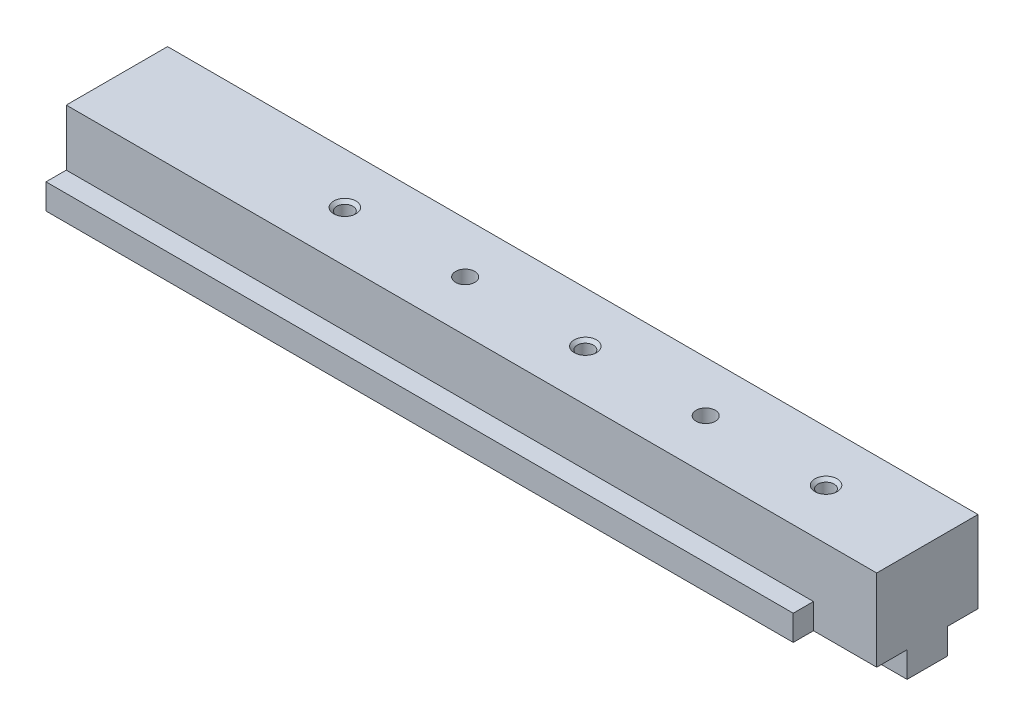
ISO-10303-21;
HEADER;
FILE_DESCRIPTION(('STEP AP214'),'2;1');
FILE_NAME('part.step','',(''),(''),'','','');
FILE_SCHEMA(('AUTOMOTIVE_DESIGN { 1 0 10303 214 1 1 1 1 }'));
ENDSEC;
DATA;
#1=APPLICATION_CONTEXT('core data for automotive mechanical design processes');
#2=APPLICATION_PROTOCOL_DEFINITION('international standard','automotive_design',2000,#1);
#3=PRODUCT_CONTEXT('',#1,'mechanical');
#4=PRODUCT('Part','Part','',(#3));
#5=PRODUCT_RELATED_PRODUCT_CATEGORY('part','',(#4));
#6=PRODUCT_DEFINITION_FORMATION('','',#4);
#7=PRODUCT_DEFINITION_CONTEXT('part definition',#1,'design');
#8=PRODUCT_DEFINITION('design','',#6,#7);
#9=PRODUCT_DEFINITION_SHAPE('','',#8);
#10=(LENGTH_UNIT() NAMED_UNIT(*) SI_UNIT(.MILLI.,.METRE.));
#11=(NAMED_UNIT(*) PLANE_ANGLE_UNIT() SI_UNIT($,.RADIAN.));
#12=(NAMED_UNIT(*) SI_UNIT($,.STERADIAN.) SOLID_ANGLE_UNIT());
#13=UNCERTAINTY_MEASURE_WITH_UNIT(LENGTH_MEASURE(1.E-05),#10,'distance_accuracy_value','');
#14=(GEOMETRIC_REPRESENTATION_CONTEXT(3) GLOBAL_UNCERTAINTY_ASSIGNED_CONTEXT((#13)) GLOBAL_UNIT_ASSIGNED_CONTEXT((#10,
#11,#12)) REPRESENTATION_CONTEXT('',''));
#15=CARTESIAN_POINT('',(0.,0.,0.));
#16=DIRECTION('',(0.,0.,1.));
#17=DIRECTION('',(1.,0.,0.));
#18=AXIS2_PLACEMENT_3D('',#15,#16,#17);
#19=CARTESIAN_POINT('',(93.6752,13.462,-6.35));
#20=DIRECTION('',(0.,-1.,0.));
#21=DIRECTION('',(0.,0.,-1.));
#22=AXIS2_PLACEMENT_3D('',#19,#20,#21);
#23=PLANE('',#22);
#24=CARTESIAN_POINT('',(43.6626,13.462,0.));
#25=DIRECTION('',(0.,1.,0.));
#26=DIRECTION('',(0.,0.,1.));
#27=AXIS2_PLACEMENT_3D('',#24,#25,#26);
#28=CIRCLE('',#27,1.20269);
#29=CARTESIAN_POINT('',(43.6626,13.462,1.20269));
#30=VERTEX_POINT('',#29);
#31=EDGE_CURVE('E452',#30,#30,#28,.T.);
#32=ORIENTED_EDGE('',*,*,#31,.F.);
#33=EDGE_LOOP('',(#32));
#34=FACE_BOUND('',#33,.T.);
#35=CARTESIAN_POINT('',(73.8124,13.462,0.));
#36=DIRECTION('',(0.,1.,0.));
#37=DIRECTION('',(0.,0.,1.));
#38=AXIS2_PLACEMENT_3D('',#35,#36,#37);
#39=CIRCLE('',#38,1.20269000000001);
#40=CARTESIAN_POINT('',(73.8124,13.462,1.20269000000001));
#41=VERTEX_POINT('',#40);
#42=EDGE_CURVE('E446',#41,#41,#39,.T.);
#43=ORIENTED_EDGE('',*,*,#42,.F.);
#44=EDGE_LOOP('',(#43));
#45=FACE_BOUND('',#44,.T.);
#46=CARTESIAN_POINT('',(58.7248,13.462,0.));
#47=DIRECTION('',(0.,1.,0.));
#48=DIRECTION('',(0.,0.,1.));
#49=AXIS2_PLACEMENT_3D('',#46,#47,#48);
#50=CIRCLE('',#49,1.397);
#51=CARTESIAN_POINT('',(58.7248,13.462,1.397));
#52=VERTEX_POINT('',#51);
#53=EDGE_CURVE('E424',#52,#52,#50,.T.);
#54=ORIENTED_EDGE('',*,*,#53,.F.);
#55=EDGE_LOOP('',(#54));
#56=FACE_BOUND('',#55,.T.);
#57=DIRECTION('',(0.,0.,1.));
#58=VECTOR('',#57,1.);
#59=CARTESIAN_POINT('',(0.,13.462,-6.35));
#60=LINE('',#59,#58);
#61=CARTESIAN_POINT('',(0.,13.462,-6.35));
#62=VERTEX_POINT('',#61);
#63=CARTESIAN_POINT('',(0.,13.462,6.35));
#64=VERTEX_POINT('',#63);
#65=EDGE_CURVE('E245',#62,#64,#60,.T.);
#66=ORIENTED_EDGE('',*,*,#65,.T.);
#67=DIRECTION('',(-1.,0.,0.));
#68=VECTOR('',#67,1.);
#69=CARTESIAN_POINT('',(93.6752,13.462,6.35));
#70=LINE('',#69,#68);
#71=CARTESIAN_POINT('',(101.6,13.462,6.35));
#72=VERTEX_POINT('',#71);
#73=EDGE_CURVE('E257',#72,#64,#70,.T.);
#74=ORIENTED_EDGE('',*,*,#73,.F.);
#75=DIRECTION('',(0.,0.,1.));
#76=VECTOR('',#75,1.);
#77=CARTESIAN_POINT('',(101.6,13.462,-6.35));
#78=LINE('',#77,#76);
#79=CARTESIAN_POINT('',(101.6,13.462,-6.35));
#80=VERTEX_POINT('',#79);
#81=EDGE_CURVE('E295',#80,#72,#78,.T.);
#82=ORIENTED_EDGE('',*,*,#81,.F.);
#83=DIRECTION('',(-1.,0.,0.));
#84=VECTOR('',#83,1.);
#85=CARTESIAN_POINT('',(93.6752,13.462,-6.35));
#86=LINE('',#85,#84);
#87=EDGE_CURVE('E260',#80,#62,#86,.T.);
#88=ORIENTED_EDGE('',*,*,#87,.T.);
#89=EDGE_LOOP('',(#66,#74,#82,#88));
#90=FACE_BOUND('',#89,.T.);
#91=CARTESIAN_POINT('',(88.9,13.462,0.));
#92=DIRECTION('',(0.,1.,0.));
#93=DIRECTION('',(0.,0.,1.));
#94=AXIS2_PLACEMENT_3D('',#91,#92,#93);
#95=CIRCLE('',#94,1.397);
#96=CARTESIAN_POINT('',(88.9,13.462,1.397));
#97=VERTEX_POINT('',#96);
#98=EDGE_CURVE('E336',#97,#97,#95,.T.);
#99=ORIENTED_EDGE('',*,*,#98,.F.);
#100=EDGE_LOOP('',(#99));
#101=FACE_BOUND('',#100,.T.);
#102=CARTESIAN_POINT('',(28.575,13.462,0.));
#103=DIRECTION('',(0.,1.,0.));
#104=DIRECTION('',(0.,0.,1.));
#105=AXIS2_PLACEMENT_3D('',#102,#103,#104);
#106=CIRCLE('',#105,1.397);
#107=CARTESIAN_POINT('',(28.575,13.462,1.397));
#108=VERTEX_POINT('',#107);
#109=EDGE_CURVE('E407',#108,#108,#106,.T.);
#110=ORIENTED_EDGE('',*,*,#109,.F.);
#111=EDGE_LOOP('',(#110));
#112=FACE_BOUND('',#111,.T.);
#113=ADVANCED_FACE('F33',(#34,#45,#56,#90,#101,#112),#23,.F.);
#114=CARTESIAN_POINT('',(93.6752,3.2258,8.89));
#115=DIRECTION('',(1.,0.,0.));
#116=DIRECTION('',(0.,0.,-1.));
#117=AXIS2_PLACEMENT_3D('',#114,#115,#116);
#118=PLANE('',#117);
#119=DIRECTION('',(0.,-1.,0.));
#120=VECTOR('',#119,1.);
#121=CARTESIAN_POINT('',(93.6752,13.462,6.35));
#122=LINE('',#121,#120);
#123=CARTESIAN_POINT('',(93.6752,6.4008,6.35));
#124=VERTEX_POINT('',#123);
#125=CARTESIAN_POINT('',(93.6752,3.2258,6.35));
#126=VERTEX_POINT('',#125);
#127=EDGE_CURVE('E11',#124,#126,#122,.T.);
#128=ORIENTED_EDGE('',*,*,#127,.F.);
#129=DIRECTION('',(0.,0.,1.));
#130=VECTOR('',#129,1.);
#131=CARTESIAN_POINT('',(93.6752,6.4008,6.35));
#132=LINE('',#131,#130);
#133=CARTESIAN_POINT('',(93.6752,6.4008,8.89));
#134=VERTEX_POINT('',#133);
#135=EDGE_CURVE('E256',#124,#134,#132,.T.);
#136=ORIENTED_EDGE('',*,*,#135,.T.);
#137=DIRECTION('',(0.,-1.,0.));
#138=VECTOR('',#137,1.);
#139=CARTESIAN_POINT('',(93.6752,6.4008,8.89));
#140=LINE('',#139,#138);
#141=CARTESIAN_POINT('',(93.6752,3.2258,8.89));
#142=VERTEX_POINT('',#141);
#143=EDGE_CURVE('E251',#134,#142,#140,.T.);
#144=ORIENTED_EDGE('',*,*,#143,.T.);
#145=DIRECTION('',(0.,0.,-1.));
#146=VECTOR('',#145,1.);
#147=CARTESIAN_POINT('',(93.6752,3.2258,8.89));
#148=LINE('',#147,#146);
#149=EDGE_CURVE('E58',#142,#126,#148,.T.);
#150=ORIENTED_EDGE('',*,*,#149,.T.);
#151=EDGE_LOOP('',(#128,#136,#144,#150));
#152=FACE_BOUND('',#151,.T.);
#153=ADVANCED_FACE('F160',(#152),#118,.T.);
#154=CARTESIAN_POINT('',(93.6752,6.4008,8.89));
#155=DIRECTION('',(0.,0.,-1.));
#156=DIRECTION('',(-1.,0.,0.));
#157=AXIS2_PLACEMENT_3D('',#154,#155,#156);
#158=PLANE('',#157);
#159=DIRECTION('',(0.,-1.,0.));
#160=VECTOR('',#159,1.);
#161=CARTESIAN_POINT('',(0.,6.4008,8.89));
#162=LINE('',#161,#160);
#163=CARTESIAN_POINT('',(0.,6.4008,8.89));
#164=VERTEX_POINT('',#163);
#165=CARTESIAN_POINT('',(0.,3.2258,8.89));
#166=VERTEX_POINT('',#165);
#167=EDGE_CURVE('E219',#164,#166,#162,.T.);
#168=ORIENTED_EDGE('',*,*,#167,.T.);
#169=DIRECTION('',(-1.,0.,0.));
#170=VECTOR('',#169,1.);
#171=CARTESIAN_POINT('',(93.6752,3.2258,8.89));
#172=LINE('',#171,#170);
#173=EDGE_CURVE('E42',#142,#166,#172,.T.);
#174=ORIENTED_EDGE('',*,*,#173,.F.);
#175=ORIENTED_EDGE('',*,*,#143,.F.);
#176=DIRECTION('',(-1.,0.,0.));
#177=VECTOR('',#176,1.);
#178=CARTESIAN_POINT('',(93.6752,6.4008,8.89));
#179=LINE('',#178,#177);
#180=EDGE_CURVE('E252',#134,#164,#179,.T.);
#181=ORIENTED_EDGE('',*,*,#180,.T.);
#182=EDGE_LOOP('',(#168,#174,#175,#181));
#183=FACE_BOUND('',#182,.T.);
#184=ADVANCED_FACE('F35',(#183),#158,.F.);
#185=CARTESIAN_POINT('',(93.6752,3.2258,8.89));
#186=DIRECTION('',(0.,1.,0.));
#187=DIRECTION('',(0.,0.,1.));
#188=AXIS2_PLACEMENT_3D('',#185,#186,#187);
#189=PLANE('',#188);
#190=DIRECTION('',(0.,0.,-1.));
#191=VECTOR('',#190,1.);
#192=CARTESIAN_POINT('',(0.,3.2258,8.89));
#193=LINE('',#192,#191);
#194=CARTESIAN_POINT('',(0.,3.2258,2.54));
#195=VERTEX_POINT('',#194);
#196=EDGE_CURVE('E209',#166,#195,#193,.T.);
#197=ORIENTED_EDGE('',*,*,#196,.T.);
#198=DIRECTION('',(-1.,0.,0.));
#199=VECTOR('',#198,1.);
#200=CARTESIAN_POINT('',(93.6752,3.2258,2.54));
#201=LINE('',#200,#199);
#202=CARTESIAN_POINT('',(101.6,3.2258,2.54));
#203=VERTEX_POINT('',#202);
#204=EDGE_CURVE('E211',#203,#195,#201,.T.);
#205=ORIENTED_EDGE('',*,*,#204,.F.);
#206=DIRECTION('',(0.,0.,-1.));
#207=VECTOR('',#206,1.);
#208=CARTESIAN_POINT('',(101.6,3.2258,6.35));
#209=LINE('',#208,#207);
#210=CARTESIAN_POINT('',(101.6,3.2258,6.35));
#211=VERTEX_POINT('',#210);
#212=EDGE_CURVE('E333',#211,#203,#209,.T.);
#213=ORIENTED_EDGE('',*,*,#212,.F.);
#214=DIRECTION('',(-1.,0.,0.));
#215=VECTOR('',#214,1.);
#216=CARTESIAN_POINT('',(101.6,3.2258,6.35));
#217=LINE('',#216,#215);
#218=EDGE_CURVE('E289',#211,#126,#217,.T.);
#219=ORIENTED_EDGE('',*,*,#218,.T.);
#220=ORIENTED_EDGE('',*,*,#149,.F.);
#221=ORIENTED_EDGE('',*,*,#173,.T.);
#222=EDGE_LOOP('',(#197,#205,#213,#219,#220,#221));
#223=FACE_BOUND('',#222,.T.);
#224=ADVANCED_FACE('F200',(#223),#189,.F.);
#225=CARTESIAN_POINT('',(93.6752,3.2258,2.54));
#226=DIRECTION('',(0.,0.,-1.));
#227=DIRECTION('',(-1.,0.,0.));
#228=AXIS2_PLACEMENT_3D('',#225,#226,#227);
#229=PLANE('',#228);
#230=DIRECTION('',(0.,-1.,0.));
#231=VECTOR('',#230,1.);
#232=CARTESIAN_POINT('',(0.,3.2258,2.54));
#233=LINE('',#232,#231);
#234=CARTESIAN_POINT('',(0.,0.,2.54));
#235=VERTEX_POINT('',#234);
#236=EDGE_CURVE('E218',#195,#235,#233,.T.);
#237=ORIENTED_EDGE('',*,*,#236,.T.);
#238=DIRECTION('',(-1.,0.,0.));
#239=VECTOR('',#238,1.);
#240=CARTESIAN_POINT('',(93.6752,0.,2.54));
#241=LINE('',#240,#239);
#242=CARTESIAN_POINT('',(101.6,0.,2.54));
#243=VERTEX_POINT('',#242);
#244=EDGE_CURVE('E225',#243,#235,#241,.T.);
#245=ORIENTED_EDGE('',*,*,#244,.F.);
#246=DIRECTION('',(0.,-1.,0.));
#247=VECTOR('',#246,1.);
#248=CARTESIAN_POINT('',(101.6,3.2258,2.54));
#249=LINE('',#248,#247);
#250=EDGE_CURVE('E224',#203,#243,#249,.T.);
#251=ORIENTED_EDGE('',*,*,#250,.F.);
#252=ORIENTED_EDGE('',*,*,#204,.T.);
#253=EDGE_LOOP('',(#237,#245,#251,#252));
#254=FACE_BOUND('',#253,.T.);
#255=ADVANCED_FACE('F197',(#254),#229,.F.);
#256=CARTESIAN_POINT('',(93.6752,0.,2.54));
#257=DIRECTION('',(0.,1.,0.));
#258=DIRECTION('',(0.,0.,1.));
#259=AXIS2_PLACEMENT_3D('',#256,#257,#258);
#260=PLANE('',#259);
#261=DIRECTION('',(0.,0.,-1.));
#262=VECTOR('',#261,1.);
#263=CARTESIAN_POINT('',(0.,0.,2.54));
#264=LINE('',#263,#262);
#265=CARTESIAN_POINT('',(0.,0.,-2.54));
#266=VERTEX_POINT('',#265);
#267=EDGE_CURVE('E230',#235,#266,#264,.T.);
#268=ORIENTED_EDGE('',*,*,#267,.T.);
#269=DIRECTION('',(-1.,0.,0.));
#270=VECTOR('',#269,1.);
#271=CARTESIAN_POINT('',(93.6752,0.,-2.54));
#272=LINE('',#271,#270);
#273=CARTESIAN_POINT('',(101.6,0.,-2.54));
#274=VERTEX_POINT('',#273);
#275=EDGE_CURVE('E273',#274,#266,#272,.T.);
#276=ORIENTED_EDGE('',*,*,#275,.F.);
#277=DIRECTION('',(0.,0.,-1.));
#278=VECTOR('',#277,1.);
#279=CARTESIAN_POINT('',(101.6,0.,2.54));
#280=LINE('',#279,#278);
#281=EDGE_CURVE('E341',#243,#274,#280,.T.);
#282=ORIENTED_EDGE('',*,*,#281,.F.);
#283=ORIENTED_EDGE('',*,*,#244,.T.);
#284=EDGE_LOOP('',(#268,#276,#282,#283));
#285=FACE_BOUND('',#284,.T.);
#286=ADVANCED_FACE('F193',(#285),#260,.F.);
#287=CARTESIAN_POINT('',(93.6752,0.,-2.54));
#288=DIRECTION('',(0.,0.,1.));
#289=DIRECTION('',(1.,0.,0.));
#290=AXIS2_PLACEMENT_3D('',#287,#288,#289);
#291=PLANE('',#290);
#292=DIRECTION('',(0.,1.,0.));
#293=VECTOR('',#292,1.);
#294=CARTESIAN_POINT('',(0.,0.,-2.54));
#295=LINE('',#294,#293);
#296=CARTESIAN_POINT('',(0.,3.2258,-2.54));
#297=VERTEX_POINT('',#296);
#298=EDGE_CURVE('E232',#266,#297,#295,.T.);
#299=ORIENTED_EDGE('',*,*,#298,.T.);
#300=DIRECTION('',(-1.,0.,0.));
#301=VECTOR('',#300,1.);
#302=CARTESIAN_POINT('',(93.6752,3.2258,-2.54));
#303=LINE('',#302,#301);
#304=CARTESIAN_POINT('',(101.6,3.2258,-2.54));
#305=VERTEX_POINT('',#304);
#306=EDGE_CURVE('E270',#305,#297,#303,.T.);
#307=ORIENTED_EDGE('',*,*,#306,.F.);
#308=DIRECTION('',(0.,1.,0.));
#309=VECTOR('',#308,1.);
#310=CARTESIAN_POINT('',(101.6,0.,-2.54));
#311=LINE('',#310,#309);
#312=EDGE_CURVE('E344',#274,#305,#311,.T.);
#313=ORIENTED_EDGE('',*,*,#312,.F.);
#314=ORIENTED_EDGE('',*,*,#275,.T.);
#315=EDGE_LOOP('',(#299,#307,#313,#314));
#316=FACE_BOUND('',#315,.T.);
#317=ADVANCED_FACE('F189',(#316),#291,.F.);
#318=CARTESIAN_POINT('',(93.6752,3.2258,-2.54));
#319=DIRECTION('',(0.,1.,0.));
#320=DIRECTION('',(0.,0.,1.));
#321=AXIS2_PLACEMENT_3D('',#318,#319,#320);
#322=PLANE('',#321);
#323=DIRECTION('',(0.,0.,-1.));
#324=VECTOR('',#323,1.);
#325=CARTESIAN_POINT('',(0.,3.2258,-2.54));
#326=LINE('',#325,#324);
#327=CARTESIAN_POINT('',(0.,3.2258,-8.89));
#328=VERTEX_POINT('',#327);
#329=EDGE_CURVE('E237',#297,#328,#326,.T.);
#330=ORIENTED_EDGE('',*,*,#329,.T.);
#331=DIRECTION('',(-1.,0.,0.));
#332=VECTOR('',#331,1.);
#333=CARTESIAN_POINT('',(93.6752,3.2258,-8.89));
#334=LINE('',#333,#332);
#335=CARTESIAN_POINT('',(93.6752,3.2258,-8.89));
#336=VERTEX_POINT('',#335);
#337=EDGE_CURVE('E267',#336,#328,#334,.T.);
#338=ORIENTED_EDGE('',*,*,#337,.F.);
#339=DIRECTION('',(0.,0.,-1.));
#340=VECTOR('',#339,1.);
#341=CARTESIAN_POINT('',(93.6752,3.2258,-2.54));
#342=LINE('',#341,#340);
#343=CARTESIAN_POINT('',(93.6752,3.2258,-6.35));
#344=VERTEX_POINT('',#343);
#345=EDGE_CURVE('E280',#344,#336,#342,.T.);
#346=ORIENTED_EDGE('',*,*,#345,.F.);
#347=DIRECTION('',(-1.,0.,0.));
#348=VECTOR('',#347,1.);
#349=CARTESIAN_POINT('',(101.6,3.2258,-6.35));
#350=LINE('',#349,#348);
#351=CARTESIAN_POINT('',(101.6,3.2258,-6.35));
#352=VERTEX_POINT('',#351);
#353=EDGE_CURVE('E291',#352,#344,#350,.T.);
#354=ORIENTED_EDGE('',*,*,#353,.F.);
#355=DIRECTION('',(0.,0.,-1.));
#356=VECTOR('',#355,1.);
#357=CARTESIAN_POINT('',(101.6,3.2258,-2.54));
#358=LINE('',#357,#356);
#359=EDGE_CURVE('E347',#305,#352,#358,.T.);
#360=ORIENTED_EDGE('',*,*,#359,.F.);
#361=ORIENTED_EDGE('',*,*,#306,.T.);
#362=EDGE_LOOP('',(#330,#338,#346,#354,#360,#361));
#363=FACE_BOUND('',#362,.T.);
#364=ADVANCED_FACE('F185',(#363),#322,.F.);
#365=CARTESIAN_POINT('',(93.6752,3.2258,-8.89));
#366=DIRECTION('',(0.,0.,1.));
#367=DIRECTION('',(1.,0.,0.));
#368=AXIS2_PLACEMENT_3D('',#365,#366,#367);
#369=PLANE('',#368);
#370=DIRECTION('',(0.,1.,0.));
#371=VECTOR('',#370,1.);
#372=CARTESIAN_POINT('',(0.,3.2258,-8.89));
#373=LINE('',#372,#371);
#374=CARTESIAN_POINT('',(0.,6.4008,-8.89));
#375=VERTEX_POINT('',#374);
#376=EDGE_CURVE('E239',#328,#375,#373,.T.);
#377=ORIENTED_EDGE('',*,*,#376,.T.);
#378=DIRECTION('',(-1.,0.,0.));
#379=VECTOR('',#378,1.);
#380=CARTESIAN_POINT('',(93.6752,6.4008,-8.89));
#381=LINE('',#380,#379);
#382=CARTESIAN_POINT('',(93.6752,6.4008,-8.89));
#383=VERTEX_POINT('',#382);
#384=EDGE_CURVE('E264',#383,#375,#381,.T.);
#385=ORIENTED_EDGE('',*,*,#384,.F.);
#386=DIRECTION('',(0.,1.,0.));
#387=VECTOR('',#386,1.);
#388=CARTESIAN_POINT('',(93.6752,3.2258,-8.89));
#389=LINE('',#388,#387);
#390=EDGE_CURVE('E287',#336,#383,#389,.T.);
#391=ORIENTED_EDGE('',*,*,#390,.F.);
#392=ORIENTED_EDGE('',*,*,#337,.T.);
#393=EDGE_LOOP('',(#377,#385,#391,#392));
#394=FACE_BOUND('',#393,.T.);
#395=ADVANCED_FACE('F181',(#394),#369,.F.);
#396=CARTESIAN_POINT('',(93.6752,6.4008,-8.89));
#397=DIRECTION('',(0.,-1.,0.));
#398=DIRECTION('',(0.,0.,-1.));
#399=AXIS2_PLACEMENT_3D('',#396,#397,#398);
#400=PLANE('',#399);
#401=DIRECTION('',(0.,0.,1.));
#402=VECTOR('',#401,1.);
#403=CARTESIAN_POINT('',(0.,6.4008,-8.89));
#404=LINE('',#403,#402);
#405=CARTESIAN_POINT('',(0.,6.4008,-6.35));
#406=VERTEX_POINT('',#405);
#407=EDGE_CURVE('E241',#375,#406,#404,.T.);
#408=ORIENTED_EDGE('',*,*,#407,.T.);
#409=DIRECTION('',(-1.,0.,0.));
#410=VECTOR('',#409,1.);
#411=CARTESIAN_POINT('',(93.6752,6.4008,-6.35));
#412=LINE('',#411,#410);
#413=CARTESIAN_POINT('',(93.6752,6.4008,-6.35));
#414=VERTEX_POINT('',#413);
#415=EDGE_CURVE('E263',#414,#406,#412,.T.);
#416=ORIENTED_EDGE('',*,*,#415,.F.);
#417=DIRECTION('',(0.,0.,1.));
#418=VECTOR('',#417,1.);
#419=CARTESIAN_POINT('',(93.6752,6.4008,-8.89));
#420=LINE('',#419,#418);
#421=EDGE_CURVE('E288',#383,#414,#420,.T.);
#422=ORIENTED_EDGE('',*,*,#421,.F.);
#423=ORIENTED_EDGE('',*,*,#384,.T.);
#424=EDGE_LOOP('',(#408,#416,#422,#423));
#425=FACE_BOUND('',#424,.T.);
#426=ADVANCED_FACE('F177',(#425),#400,.F.);
#427=CARTESIAN_POINT('',(93.6752,6.4008,-6.35));
#428=DIRECTION('',(0.,0.,1.));
#429=DIRECTION('',(1.,0.,0.));
#430=AXIS2_PLACEMENT_3D('',#427,#428,#429);
#431=PLANE('',#430);
#432=DIRECTION('',(0.,1.,0.));
#433=VECTOR('',#432,1.);
#434=CARTESIAN_POINT('',(0.,6.4008,-6.35));
#435=LINE('',#434,#433);
#436=EDGE_CURVE('E243',#406,#62,#435,.T.);
#437=ORIENTED_EDGE('',*,*,#436,.T.);
#438=ORIENTED_EDGE('',*,*,#87,.F.);
#439=DIRECTION('',(0.,1.,0.));
#440=VECTOR('',#439,1.);
#441=CARTESIAN_POINT('',(101.6,3.2258,-6.35));
#442=LINE('',#441,#440);
#443=EDGE_CURVE('E349',#352,#80,#442,.T.);
#444=ORIENTED_EDGE('',*,*,#443,.F.);
#445=ORIENTED_EDGE('',*,*,#353,.T.);
#446=DIRECTION('',(0.,1.,0.));
#447=VECTOR('',#446,1.);
#448=CARTESIAN_POINT('',(93.6752,3.2258,-6.35));
#449=LINE('',#448,#447);
#450=EDGE_CURVE('E50',#344,#414,#449,.T.);
#451=ORIENTED_EDGE('',*,*,#450,.T.);
#452=ORIENTED_EDGE('',*,*,#415,.T.);
#453=EDGE_LOOP('',(#437,#438,#444,#445,#451,#452));
#454=FACE_BOUND('',#453,.T.);
#455=ADVANCED_FACE('F174',(#454),#431,.F.);
#456=CARTESIAN_POINT('',(93.6752,13.462,6.35));
#457=DIRECTION('',(0.,0.,-1.));
#458=DIRECTION('',(-1.,0.,0.));
#459=AXIS2_PLACEMENT_3D('',#456,#457,#458);
#460=PLANE('',#459);
#461=DIRECTION('',(0.,-1.,0.));
#462=VECTOR('',#461,1.);
#463=CARTESIAN_POINT('',(0.,13.462,6.35));
#464=LINE('',#463,#462);
#465=CARTESIAN_POINT('',(0.,6.4008,6.35));
#466=VERTEX_POINT('',#465);
#467=EDGE_CURVE('E247',#64,#466,#464,.T.);
#468=ORIENTED_EDGE('',*,*,#467,.T.);
#469=DIRECTION('',(-1.,0.,0.));
#470=VECTOR('',#469,1.);
#471=CARTESIAN_POINT('',(93.6752,6.4008,6.35));
#472=LINE('',#471,#470);
#473=EDGE_CURVE('E255',#124,#466,#472,.T.);
#474=ORIENTED_EDGE('',*,*,#473,.F.);
#475=ORIENTED_EDGE('',*,*,#127,.T.);
#476=ORIENTED_EDGE('',*,*,#218,.F.);
#477=DIRECTION('',(0.,-1.,0.));
#478=VECTOR('',#477,1.);
#479=CARTESIAN_POINT('',(101.6,13.462,6.35));
#480=LINE('',#479,#478);
#481=EDGE_CURVE('E331',#72,#211,#480,.T.);
#482=ORIENTED_EDGE('',*,*,#481,.F.);
#483=ORIENTED_EDGE('',*,*,#73,.T.);
#484=EDGE_LOOP('',(#468,#474,#475,#476,#482,#483));
#485=FACE_BOUND('',#484,.T.);
#486=ADVANCED_FACE('F172',(#485),#460,.F.);
#487=CARTESIAN_POINT('',(93.6752,6.4008,6.35));
#488=DIRECTION('',(0.,-1.,0.));
#489=DIRECTION('',(0.,0.,-1.));
#490=AXIS2_PLACEMENT_3D('',#487,#488,#489);
#491=PLANE('',#490);
#492=DIRECTION('',(0.,0.,1.));
#493=VECTOR('',#492,1.);
#494=CARTESIAN_POINT('',(0.,6.4008,6.35));
#495=LINE('',#494,#493);
#496=EDGE_CURVE('E249',#466,#164,#495,.T.);
#497=ORIENTED_EDGE('',*,*,#496,.T.);
#498=ORIENTED_EDGE('',*,*,#180,.F.);
#499=ORIENTED_EDGE('',*,*,#135,.F.);
#500=ORIENTED_EDGE('',*,*,#473,.T.);
#501=EDGE_LOOP('',(#497,#498,#499,#500));
#502=FACE_BOUND('',#501,.T.);
#503=ADVANCED_FACE('F366',(#502),#491,.F.);
#504=ORIENTED_EDGE('',*,*,#450,.F.);
#505=ORIENTED_EDGE('',*,*,#345,.T.);
#506=ORIENTED_EDGE('',*,*,#390,.T.);
#507=ORIENTED_EDGE('',*,*,#421,.T.);
#508=EDGE_LOOP('',(#504,#505,#506,#507));
#509=FACE_BOUND('',#508,.T.);
#510=ADVANCED_FACE('F167',(#509),#118,.T.);
#511=CARTESIAN_POINT('',(0.,3.2258,8.89));
#512=DIRECTION('',(1.,0.,0.));
#513=DIRECTION('',(0.,0.,-1.));
#514=AXIS2_PLACEMENT_3D('',#511,#512,#513);
#515=PLANE('',#514);
#516=ORIENTED_EDGE('',*,*,#167,.F.);
#517=ORIENTED_EDGE('',*,*,#496,.F.);
#518=ORIENTED_EDGE('',*,*,#467,.F.);
#519=ORIENTED_EDGE('',*,*,#65,.F.);
#520=ORIENTED_EDGE('',*,*,#436,.F.);
#521=ORIENTED_EDGE('',*,*,#407,.F.);
#522=ORIENTED_EDGE('',*,*,#376,.F.);
#523=ORIENTED_EDGE('',*,*,#329,.F.);
#524=ORIENTED_EDGE('',*,*,#298,.F.);
#525=ORIENTED_EDGE('',*,*,#267,.F.);
#526=ORIENTED_EDGE('',*,*,#236,.F.);
#527=ORIENTED_EDGE('',*,*,#196,.F.);
#528=EDGE_LOOP('',(#516,#517,#518,#519,#520,#521,#522,#523,#524,#525,#526,#527));
#529=FACE_BOUND('',#528,.T.);
#530=ADVANCED_FACE('F228',(#529),#515,.F.);
#531=CARTESIAN_POINT('',(101.6,3.2258,6.35));
#532=DIRECTION('',(1.,0.,0.));
#533=DIRECTION('',(0.,0.,-1.));
#534=AXIS2_PLACEMENT_3D('',#531,#532,#533);
#535=PLANE('',#534);
#536=ORIENTED_EDGE('',*,*,#481,.T.);
#537=ORIENTED_EDGE('',*,*,#212,.T.);
#538=ORIENTED_EDGE('',*,*,#250,.T.);
#539=ORIENTED_EDGE('',*,*,#281,.T.);
#540=ORIENTED_EDGE('',*,*,#312,.T.);
#541=ORIENTED_EDGE('',*,*,#359,.T.);
#542=ORIENTED_EDGE('',*,*,#443,.T.);
#543=ORIENTED_EDGE('',*,*,#81,.T.);
#544=EDGE_LOOP('',(#536,#537,#538,#539,#540,#541,#542,#543));
#545=FACE_BOUND('',#544,.T.);
#546=ADVANCED_FACE('F355',(#545),#535,.T.);
#547=CARTESIAN_POINT('',(88.9,13.081,0.));
#548=DIRECTION('',(0.,1.,0.));
#549=DIRECTION('',(0.,0.,1.));
#550=AXIS2_PLACEMENT_3D('',#547,#548,#549);
#551=CONICAL_SURFACE('',#550,1.016,0.785398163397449);
#552=ORIENTED_EDGE('',*,*,#98,.T.);
#553=EDGE_LOOP('',(#552));
#554=FACE_BOUND('',#553,.T.);
#555=CARTESIAN_POINT('',(88.9,13.081,0.));
#556=DIRECTION('',(0.,1.,0.));
#557=DIRECTION('',(0.,0.,1.));
#558=AXIS2_PLACEMENT_3D('',#555,#556,#557);
#559=CIRCLE('',#558,1.016);
#560=CARTESIAN_POINT('',(88.9,13.081,1.016));
#561=VERTEX_POINT('',#560);
#562=EDGE_CURVE('E429',#561,#561,#559,.T.);
#563=ORIENTED_EDGE('',*,*,#562,.F.);
#564=EDGE_LOOP('',(#563));
#565=FACE_BOUND('',#564,.T.);
#566=ADVANCED_FACE('F376',(#554,#565),#551,.F.);
#567=CARTESIAN_POINT('',(88.9,5.207,0.));
#568=DIRECTION('',(0.,1.,0.));
#569=DIRECTION('',(0.,0.,1.));
#570=AXIS2_PLACEMENT_3D('',#567,#568,#569);
#571=CYLINDRICAL_SURFACE('',#570,1.016);
#572=ORIENTED_EDGE('',*,*,#562,.T.);
#573=EDGE_LOOP('',(#572));
#574=FACE_BOUND('',#573,.T.);
#575=CARTESIAN_POINT('',(88.9,5.7935878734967,0.));
#576=DIRECTION('',(0.,1.,0.));
#577=DIRECTION('',(0.,0.,1.));
#578=AXIS2_PLACEMENT_3D('',#575,#576,#577);
#579=CIRCLE('',#578,1.016);
#580=CARTESIAN_POINT('',(88.9,5.7935878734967,1.016));
#581=VERTEX_POINT('',#580);
#582=EDGE_CURVE('E427',#581,#581,#579,.T.);
#583=ORIENTED_EDGE('',*,*,#582,.F.);
#584=EDGE_LOOP('',(#583));
#585=FACE_BOUND('',#584,.T.);
#586=ADVANCED_FACE('F379',(#574,#585),#571,.F.);
#587=CARTESIAN_POINT('',(88.9,5.207,0.));
#588=DIRECTION('',(0.,1.,0.));
#589=DIRECTION('',(0.,0.,1.));
#590=AXIS2_PLACEMENT_3D('',#587,#588,#589);
#591=CONICAL_SURFACE('',#590,0.,1.04719755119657);
#592=ORIENTED_EDGE('',*,*,#582,.T.);
#593=EDGE_LOOP('',(#592));
#594=FACE_BOUND('',#593,.T.);
#595=CARTESIAN_POINT('',(88.9,5.207,0.));
#596=VERTEX_POINT('',#595);
#597=VERTEX_LOOP('',#596);
#598=FACE_BOUND('',#597,.T.);
#599=ADVANCED_FACE('F383',(#594,#598),#591,.F.);
#600=CARTESIAN_POINT('',(58.7248,13.081,0.));
#601=DIRECTION('',(0.,1.,0.));
#602=DIRECTION('',(0.,0.,1.));
#603=AXIS2_PLACEMENT_3D('',#600,#601,#602);
#604=CONICAL_SURFACE('',#603,1.016,0.785398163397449);
#605=ORIENTED_EDGE('',*,*,#53,.T.);
#606=EDGE_LOOP('',(#605));
#607=FACE_BOUND('',#606,.T.);
#608=CARTESIAN_POINT('',(58.7248,13.081,0.));
#609=DIRECTION('',(0.,1.,0.));
#610=DIRECTION('',(0.,0.,1.));
#611=AXIS2_PLACEMENT_3D('',#608,#609,#610);
#612=CIRCLE('',#611,1.016);
#613=CARTESIAN_POINT('',(58.7248,13.081,1.016));
#614=VERTEX_POINT('',#613);
#615=EDGE_CURVE('E421',#614,#614,#612,.T.);
#616=ORIENTED_EDGE('',*,*,#615,.F.);
#617=EDGE_LOOP('',(#616));
#618=FACE_BOUND('',#617,.T.);
#619=ADVANCED_FACE('F387',(#607,#618),#604,.F.);
#620=CARTESIAN_POINT('',(58.7248,5.207,0.));
#621=DIRECTION('',(0.,1.,0.));
#622=DIRECTION('',(0.,0.,1.));
#623=AXIS2_PLACEMENT_3D('',#620,#621,#622);
#624=CYLINDRICAL_SURFACE('',#623,1.016);
#625=ORIENTED_EDGE('',*,*,#615,.T.);
#626=EDGE_LOOP('',(#625));
#627=FACE_BOUND('',#626,.T.);
#628=CARTESIAN_POINT('',(58.7248,5.7935878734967,0.));
#629=DIRECTION('',(0.,1.,0.));
#630=DIRECTION('',(0.,0.,1.));
#631=AXIS2_PLACEMENT_3D('',#628,#629,#630);
#632=CIRCLE('',#631,1.016);
#633=CARTESIAN_POINT('',(58.7248,5.7935878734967,1.016));
#634=VERTEX_POINT('',#633);
#635=EDGE_CURVE('E413',#634,#634,#632,.T.);
#636=ORIENTED_EDGE('',*,*,#635,.F.);
#637=EDGE_LOOP('',(#636));
#638=FACE_BOUND('',#637,.T.);
#639=ADVANCED_FACE('F391',(#627,#638),#624,.F.);
#640=CARTESIAN_POINT('',(58.7248,5.207,0.));
#641=DIRECTION('',(0.,1.,0.));
#642=DIRECTION('',(0.,0.,1.));
#643=AXIS2_PLACEMENT_3D('',#640,#641,#642);
#644=CONICAL_SURFACE('',#643,0.,1.04719755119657);
#645=ORIENTED_EDGE('',*,*,#635,.T.);
#646=EDGE_LOOP('',(#645));
#647=FACE_BOUND('',#646,.T.);
#648=CARTESIAN_POINT('',(58.7248,5.207,0.));
#649=VERTEX_POINT('',#648);
#650=VERTEX_LOOP('',#649);
#651=FACE_BOUND('',#650,.T.);
#652=ADVANCED_FACE('F395',(#647,#651),#644,.F.);
#653=CARTESIAN_POINT('',(28.575,13.081,0.));
#654=DIRECTION('',(0.,1.,0.));
#655=DIRECTION('',(0.,0.,1.));
#656=AXIS2_PLACEMENT_3D('',#653,#654,#655);
#657=CONICAL_SURFACE('',#656,1.016,0.785398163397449);
#658=ORIENTED_EDGE('',*,*,#109,.T.);
#659=EDGE_LOOP('',(#658));
#660=FACE_BOUND('',#659,.T.);
#661=CARTESIAN_POINT('',(28.575,13.081,0.));
#662=DIRECTION('',(0.,1.,0.));
#663=DIRECTION('',(0.,0.,1.));
#664=AXIS2_PLACEMENT_3D('',#661,#662,#663);
#665=CIRCLE('',#664,1.016);
#666=CARTESIAN_POINT('',(28.575,13.081,1.016));
#667=VERTEX_POINT('',#666);
#668=EDGE_CURVE('E410',#667,#667,#665,.T.);
#669=ORIENTED_EDGE('',*,*,#668,.F.);
#670=EDGE_LOOP('',(#669));
#671=FACE_BOUND('',#670,.T.);
#672=ADVANCED_FACE('F155',(#660,#671),#657,.F.);
#673=CARTESIAN_POINT('',(28.575,5.207,0.));
#674=DIRECTION('',(0.,1.,0.));
#675=DIRECTION('',(0.,0.,1.));
#676=AXIS2_PLACEMENT_3D('',#673,#674,#675);
#677=CYLINDRICAL_SURFACE('',#676,1.016);
#678=ORIENTED_EDGE('',*,*,#668,.T.);
#679=EDGE_LOOP('',(#678));
#680=FACE_BOUND('',#679,.T.);
#681=CARTESIAN_POINT('',(28.575,5.7935878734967,0.));
#682=DIRECTION('',(0.,1.,0.));
#683=DIRECTION('',(0.,0.,1.));
#684=AXIS2_PLACEMENT_3D('',#681,#682,#683);
#685=CIRCLE('',#684,1.016);
#686=CARTESIAN_POINT('',(28.575,5.7935878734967,1.016));
#687=VERTEX_POINT('',#686);
#688=EDGE_CURVE('E411',#687,#687,#685,.T.);
#689=ORIENTED_EDGE('',*,*,#688,.F.);
#690=EDGE_LOOP('',(#689));
#691=FACE_BOUND('',#690,.T.);
#692=ADVANCED_FACE('F145',(#680,#691),#677,.F.);
#693=CARTESIAN_POINT('',(28.575,5.207,0.));
#694=DIRECTION('',(0.,1.,0.));
#695=DIRECTION('',(0.,0.,1.));
#696=AXIS2_PLACEMENT_3D('',#693,#694,#695);
#697=CONICAL_SURFACE('',#696,0.,1.04719755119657);
#698=ORIENTED_EDGE('',*,*,#688,.T.);
#699=EDGE_LOOP('',(#698));
#700=FACE_BOUND('',#699,.T.);
#701=CARTESIAN_POINT('',(28.575,5.207,0.));
#702=VERTEX_POINT('',#701);
#703=VERTEX_LOOP('',#702);
#704=FACE_BOUND('',#703,.T.);
#705=ADVANCED_FACE('F142',(#700,#704),#697,.F.);
#706=CARTESIAN_POINT('',(73.8124,10.414,0.));
#707=DIRECTION('',(0.,1.,0.));
#708=DIRECTION('',(0.,0.,1.));
#709=AXIS2_PLACEMENT_3D('',#706,#707,#708);
#710=CYLINDRICAL_SURFACE('',#709,1.20269000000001);
#711=CARTESIAN_POINT('',(73.8124,10.414,0.));
#712=DIRECTION('',(0.,1.,0.));
#713=DIRECTION('',(0.,0.,1.));
#714=AXIS2_PLACEMENT_3D('',#711,#712,#713);
#715=CIRCLE('',#714,1.20269000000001);
#716=CARTESIAN_POINT('',(73.8124,10.414,1.20269000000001));
#717=VERTEX_POINT('',#716);
#718=EDGE_CURVE('E415',#717,#717,#715,.T.);
#719=CARTESIAN_POINT('',(73.8124,10.414,1.20269000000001));
#720=CARTESIAN_POINT('',(73.8124,10.44575,1.20269000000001));
#721=CARTESIAN_POINT('',(73.8124,10.4775,1.20269000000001));
#722=CARTESIAN_POINT('',(73.8124,10.541,1.20269000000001));
#723=CARTESIAN_POINT('',(73.8124,10.57275,1.20269000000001));
#724=CARTESIAN_POINT('',(73.8124,10.63625,1.20269000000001));
#725=CARTESIAN_POINT('',(73.8124,10.668,1.20269000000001));
#726=CARTESIAN_POINT('',(73.8124,10.7315,1.20269000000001));
#727=CARTESIAN_POINT('',(73.8124,10.76325,1.20269000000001));
#728=CARTESIAN_POINT('',(73.8124,10.82675,1.20269000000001));
#729=CARTESIAN_POINT('',(73.8124,10.8585,1.20269000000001));
#730=CARTESIAN_POINT('',(73.8124,10.922,1.20269000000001));
#731=CARTESIAN_POINT('',(73.8124,10.95375,1.20269000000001));
#732=CARTESIAN_POINT('',(73.8124,11.01725,1.20269000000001));
#733=CARTESIAN_POINT('',(73.8124,11.049,1.20269000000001));
#734=CARTESIAN_POINT('',(73.8124,11.1125,1.20269000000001));
#735=CARTESIAN_POINT('',(73.8124,11.14425,1.20269000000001));
#736=CARTESIAN_POINT('',(73.8124,11.20775,1.20269000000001));
#737=CARTESIAN_POINT('',(73.8124,11.2395,1.20269000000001));
#738=CARTESIAN_POINT('',(73.8124,11.303,1.20269000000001));
#739=CARTESIAN_POINT('',(73.8124,11.33475,1.20269000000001));
#740=CARTESIAN_POINT('',(73.8124,11.39825,1.20269000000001));
#741=CARTESIAN_POINT('',(73.8124,11.43,1.20269000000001));
#742=CARTESIAN_POINT('',(73.8124,11.4935,1.20269000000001));
#743=CARTESIAN_POINT('',(73.8124,11.52525,1.20269000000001));
#744=CARTESIAN_POINT('',(73.8124,11.58875,1.20269000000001));
#745=CARTESIAN_POINT('',(73.8124,11.6205,1.20269000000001));
#746=CARTESIAN_POINT('',(73.8124,11.684,1.20269000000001));
#747=CARTESIAN_POINT('',(73.8124,11.71575,1.20269000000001));
#748=CARTESIAN_POINT('',(73.8124,11.77925,1.20269000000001));
#749=CARTESIAN_POINT('',(73.8124,11.811,1.20269000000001));
#750=CARTESIAN_POINT('',(73.8124,11.8745,1.20269000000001));
#751=CARTESIAN_POINT('',(73.8124,11.90625,1.20269000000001));
#752=CARTESIAN_POINT('',(73.8124,11.96975,1.20269000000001));
#753=CARTESIAN_POINT('',(73.8124,12.0015,1.20269000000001));
#754=CARTESIAN_POINT('',(73.8124,12.065,1.20269000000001));
#755=CARTESIAN_POINT('',(73.8124,12.09675,1.20269000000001));
#756=CARTESIAN_POINT('',(73.8124,12.16025,1.20269000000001));
#757=CARTESIAN_POINT('',(73.8124,12.192,1.20269000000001));
#758=CARTESIAN_POINT('',(73.8124,12.2555,1.20269000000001));
#759=CARTESIAN_POINT('',(73.8124,12.28725,1.20269000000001));
#760=CARTESIAN_POINT('',(73.8124,12.35075,1.20269000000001));
#761=CARTESIAN_POINT('',(73.8124,12.3825,1.20269000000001));
#762=CARTESIAN_POINT('',(73.8124,12.446,1.20269000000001));
#763=CARTESIAN_POINT('',(73.8124,12.47775,1.20269000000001));
#764=CARTESIAN_POINT('',(73.8124,12.54125,1.20269000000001));
#765=CARTESIAN_POINT('',(73.8124,12.573,1.20269000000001));
#766=CARTESIAN_POINT('',(73.8124,12.6365,1.20269000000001));
#767=CARTESIAN_POINT('',(73.8124,12.66825,1.20269000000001));
#768=CARTESIAN_POINT('',(73.8124,12.73175,1.20269000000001));
#769=CARTESIAN_POINT('',(73.8124,12.7635,1.20269000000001));
#770=CARTESIAN_POINT('',(73.8124,12.827,1.20269000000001));
#771=CARTESIAN_POINT('',(73.8124,12.85875,1.20269000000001));
#772=CARTESIAN_POINT('',(73.8124,12.92225,1.20269000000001));
#773=CARTESIAN_POINT('',(73.8124,12.954,1.20269000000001));
#774=CARTESIAN_POINT('',(73.8124,13.0175,1.20269000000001));
#775=CARTESIAN_POINT('',(73.8124,13.04925,1.20269000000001));
#776=CARTESIAN_POINT('',(73.8124,13.11275,1.20269000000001));
#777=CARTESIAN_POINT('',(73.8124,13.1445,1.20269000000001));
#778=CARTESIAN_POINT('',(73.8124,13.208,1.20269000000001));
#779=CARTESIAN_POINT('',(73.8124,13.23975,1.20269000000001));
#780=CARTESIAN_POINT('',(73.8124,13.30325,1.20269000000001));
#781=CARTESIAN_POINT('',(73.8124,13.335,1.20269000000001));
#782=CARTESIAN_POINT('',(73.8124,13.3985,1.20269000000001));
#783=CARTESIAN_POINT('',(73.8124,13.43025,1.20269000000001));
#784=CARTESIAN_POINT('',(73.8124,13.462,1.20269000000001));
#785=B_SPLINE_CURVE_WITH_KNOTS('',3,(#719,#720,#721,#722,#723,#724,#725,#726,#727,#728,#729,
#730,#731,#732,#733,#734,#735,#736,#737,#738,#739,#740,#741,#742,#743,#744,#745,#746,#747,#748,
#749,#750,#751,#752,#753,#754,#755,#756,#757,#758,#759,#760,#761,#762,#763,#764,#765,#766,#767,
#768,#769,#770,#771,#772,#773,#774,#775,#776,#777,#778,#779,#780,#781,#782,#783,#784),
.UNSPECIFIED.,.F.,.F.,(4,2,2,2,2,2,2,2,2,2,2,2,2,2,2,2,2,2,2,2,2,2,2,2,2,2,2,2,2,2,2,2,4),(0.,
0.0952499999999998,0.1905,0.28575,0.380999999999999,0.476249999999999,0.571499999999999,
0.666749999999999,0.761999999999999,0.857249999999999,0.9525,1.04775,1.143,1.23825,1.3335,
1.42875,1.524,1.61925,1.7145,1.80975,1.905,2.00025,2.0955,2.19075,2.286,2.38125,2.4765,2.57175,
2.667,2.76225,2.8575,2.95275,3.048),.UNSPECIFIED.);
#786=EDGE_CURVE('BSEAM144',#717,#41,#785,.T.);
#787=ORIENTED_EDGE('',*,*,#718,.F.);
#788=ORIENTED_EDGE('',*,*,#42,.T.);
#789=ORIENTED_EDGE('',*,*,#786,.T.);
#790=ORIENTED_EDGE('',*,*,#786,.F.);
#791=EDGE_LOOP('',(#787,#789,#788,#790));
#792=FACE_BOUND('',#791,.T.);
#793=ADVANCED_FACE('F144',(#792),#710,.F.);
#794=CARTESIAN_POINT('',(73.8124,10.414,0.));
#795=DIRECTION('',(0.,1.,0.));
#796=DIRECTION('',(0.,0.,1.));
#797=AXIS2_PLACEMENT_3D('',#794,#795,#796);
#798=PLANE('',#797);
#799=ORIENTED_EDGE('',*,*,#718,.T.);
#800=EDGE_LOOP('',(#799));
#801=FACE_BOUND('',#800,.T.);
#802=ADVANCED_FACE('F152',(#801),#798,.T.);
#803=CARTESIAN_POINT('',(43.6626,10.414,0.));
#804=DIRECTION('',(0.,1.,0.));
#805=DIRECTION('',(0.,0.,1.));
#806=AXIS2_PLACEMENT_3D('',#803,#804,#805);
#807=CYLINDRICAL_SURFACE('',#806,1.20269);
#808=CARTESIAN_POINT('',(43.6626,10.414,0.));
#809=DIRECTION('',(0.,1.,0.));
#810=DIRECTION('',(0.,0.,1.));
#811=AXIS2_PLACEMENT_3D('',#808,#809,#810);
#812=CIRCLE('',#811,1.20269);
#813=CARTESIAN_POINT('',(43.6626,10.414,1.20269));
#814=VERTEX_POINT('',#813);
#815=EDGE_CURVE('E449',#814,#814,#812,.T.);
#816=CARTESIAN_POINT('',(43.6626,10.414,1.20269));
#817=CARTESIAN_POINT('',(43.6626,10.44575,1.20269));
#818=CARTESIAN_POINT('',(43.6626,10.4775,1.20269));
#819=CARTESIAN_POINT('',(43.6626,10.541,1.20269));
#820=CARTESIAN_POINT('',(43.6626,10.57275,1.20269));
#821=CARTESIAN_POINT('',(43.6626,10.63625,1.20269));
#822=CARTESIAN_POINT('',(43.6626,10.668,1.20269));
#823=CARTESIAN_POINT('',(43.6626,10.7315,1.20269));
#824=CARTESIAN_POINT('',(43.6626,10.76325,1.20269));
#825=CARTESIAN_POINT('',(43.6626,10.82675,1.20269));
#826=CARTESIAN_POINT('',(43.6626,10.8585,1.20269));
#827=CARTESIAN_POINT('',(43.6626,10.922,1.20269));
#828=CARTESIAN_POINT('',(43.6626,10.95375,1.20269));
#829=CARTESIAN_POINT('',(43.6626,11.01725,1.20269));
#830=CARTESIAN_POINT('',(43.6626,11.049,1.20269));
#831=CARTESIAN_POINT('',(43.6626,11.1125,1.20269));
#832=CARTESIAN_POINT('',(43.6626,11.14425,1.20269));
#833=CARTESIAN_POINT('',(43.6626,11.20775,1.20269));
#834=CARTESIAN_POINT('',(43.6626,11.2395,1.20269));
#835=CARTESIAN_POINT('',(43.6626,11.303,1.20269));
#836=CARTESIAN_POINT('',(43.6626,11.33475,1.20269));
#837=CARTESIAN_POINT('',(43.6626,11.39825,1.20269));
#838=CARTESIAN_POINT('',(43.6626,11.43,1.20269));
#839=CARTESIAN_POINT('',(43.6626,11.4935,1.20269));
#840=CARTESIAN_POINT('',(43.6626,11.52525,1.20269));
#841=CARTESIAN_POINT('',(43.6626,11.58875,1.20269));
#842=CARTESIAN_POINT('',(43.6626,11.6205,1.20269));
#843=CARTESIAN_POINT('',(43.6626,11.684,1.20269));
#844=CARTESIAN_POINT('',(43.6626,11.71575,1.20269));
#845=CARTESIAN_POINT('',(43.6626,11.77925,1.20269));
#846=CARTESIAN_POINT('',(43.6626,11.811,1.20269));
#847=CARTESIAN_POINT('',(43.6626,11.8745,1.20269));
#848=CARTESIAN_POINT('',(43.6626,11.90625,1.20269));
#849=CARTESIAN_POINT('',(43.6626,11.96975,1.20269));
#850=CARTESIAN_POINT('',(43.6626,12.0015,1.20269));
#851=CARTESIAN_POINT('',(43.6626,12.065,1.20269));
#852=CARTESIAN_POINT('',(43.6626,12.09675,1.20269));
#853=CARTESIAN_POINT('',(43.6626,12.16025,1.20269));
#854=CARTESIAN_POINT('',(43.6626,12.192,1.20269));
#855=CARTESIAN_POINT('',(43.6626,12.2555,1.20269));
#856=CARTESIAN_POINT('',(43.6626,12.28725,1.20269));
#857=CARTESIAN_POINT('',(43.6626,12.35075,1.20269));
#858=CARTESIAN_POINT('',(43.6626,12.3825,1.20269));
#859=CARTESIAN_POINT('',(43.6626,12.446,1.20269));
#860=CARTESIAN_POINT('',(43.6626,12.47775,1.20269));
#861=CARTESIAN_POINT('',(43.6626,12.54125,1.20269));
#862=CARTESIAN_POINT('',(43.6626,12.573,1.20269));
#863=CARTESIAN_POINT('',(43.6626,12.6365,1.20269));
#864=CARTESIAN_POINT('',(43.6626,12.66825,1.20269));
#865=CARTESIAN_POINT('',(43.6626,12.73175,1.20269));
#866=CARTESIAN_POINT('',(43.6626,12.7635,1.20269));
#867=CARTESIAN_POINT('',(43.6626,12.827,1.20269));
#868=CARTESIAN_POINT('',(43.6626,12.85875,1.20269));
#869=CARTESIAN_POINT('',(43.6626,12.92225,1.20269));
#870=CARTESIAN_POINT('',(43.6626,12.954,1.20269));
#871=CARTESIAN_POINT('',(43.6626,13.0175,1.20269));
#872=CARTESIAN_POINT('',(43.6626,13.04925,1.20269));
#873=CARTESIAN_POINT('',(43.6626,13.11275,1.20269));
#874=CARTESIAN_POINT('',(43.6626,13.1445,1.20269));
#875=CARTESIAN_POINT('',(43.6626,13.208,1.20269));
#876=CARTESIAN_POINT('',(43.6626,13.23975,1.20269));
#877=CARTESIAN_POINT('',(43.6626,13.30325,1.20269));
#878=CARTESIAN_POINT('',(43.6626,13.335,1.20269));
#879=CARTESIAN_POINT('',(43.6626,13.3985,1.20269));
#880=CARTESIAN_POINT('',(43.6626,13.43025,1.20269));
#881=CARTESIAN_POINT('',(43.6626,13.462,1.20269));
#882=B_SPLINE_CURVE_WITH_KNOTS('',3,(#816,#817,#818,#819,#820,#821,#822,#823,#824,#825,#826,
#827,#828,#829,#830,#831,#832,#833,#834,#835,#836,#837,#838,#839,#840,#841,#842,#843,#844,#845,
#846,#847,#848,#849,#850,#851,#852,#853,#854,#855,#856,#857,#858,#859,#860,#861,#862,#863,#864,
#865,#866,#867,#868,#869,#870,#871,#872,#873,#874,#875,#876,#877,#878,#879,#880,#881),
.UNSPECIFIED.,.F.,.F.,(4,2,2,2,2,2,2,2,2,2,2,2,2,2,2,2,2,2,2,2,2,2,2,2,2,2,2,2,2,2,2,2,4),(0.,
0.0952499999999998,0.1905,0.28575,0.380999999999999,0.476249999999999,0.571499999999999,
0.666749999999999,0.761999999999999,0.857249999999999,0.9525,1.04775,1.143,1.23825,1.3335,
1.42875,1.524,1.61925,1.7145,1.80975,1.905,2.00025,2.0955,2.19075,2.286,2.38125,2.4765,2.57175,
2.667,2.76225,2.8575,2.95275,3.048),.UNSPECIFIED.);
#883=EDGE_CURVE('BSEAM460',#814,#30,#882,.T.);
#884=ORIENTED_EDGE('',*,*,#815,.F.);
#885=ORIENTED_EDGE('',*,*,#31,.T.);
#886=ORIENTED_EDGE('',*,*,#883,.T.);
#887=ORIENTED_EDGE('',*,*,#883,.F.);
#888=EDGE_LOOP('',(#884,#886,#885,#887));
#889=FACE_BOUND('',#888,.T.);
#890=ADVANCED_FACE('F460',(#889),#807,.F.);
#891=CARTESIAN_POINT('',(43.6626,10.414,0.));
#892=DIRECTION('',(0.,1.,0.));
#893=DIRECTION('',(0.,0.,1.));
#894=AXIS2_PLACEMENT_3D('',#891,#892,#893);
#895=PLANE('',#894);
#896=ORIENTED_EDGE('',*,*,#815,.T.);
#897=EDGE_LOOP('',(#896));
#898=FACE_BOUND('',#897,.T.);
#899=ADVANCED_FACE('F458',(#898),#895,.T.);
#900=CLOSED_SHELL('',(#113,#153,#184,#224,#255,#286,#317,#364,#395,#426,#455,#486,#503,#510,
#530,#546,#566,#586,#599,#619,#639,#652,#672,#692,#705,#793,#802,#890,#899));
#901=MANIFOLD_SOLID_BREP('B2',#900);
#902=ADVANCED_BREP_SHAPE_REPRESENTATION('',(#18,#901),#14);
#903=SHAPE_DEFINITION_REPRESENTATION(#9,#902);
ENDSEC;
END-ISO-10303-21;
